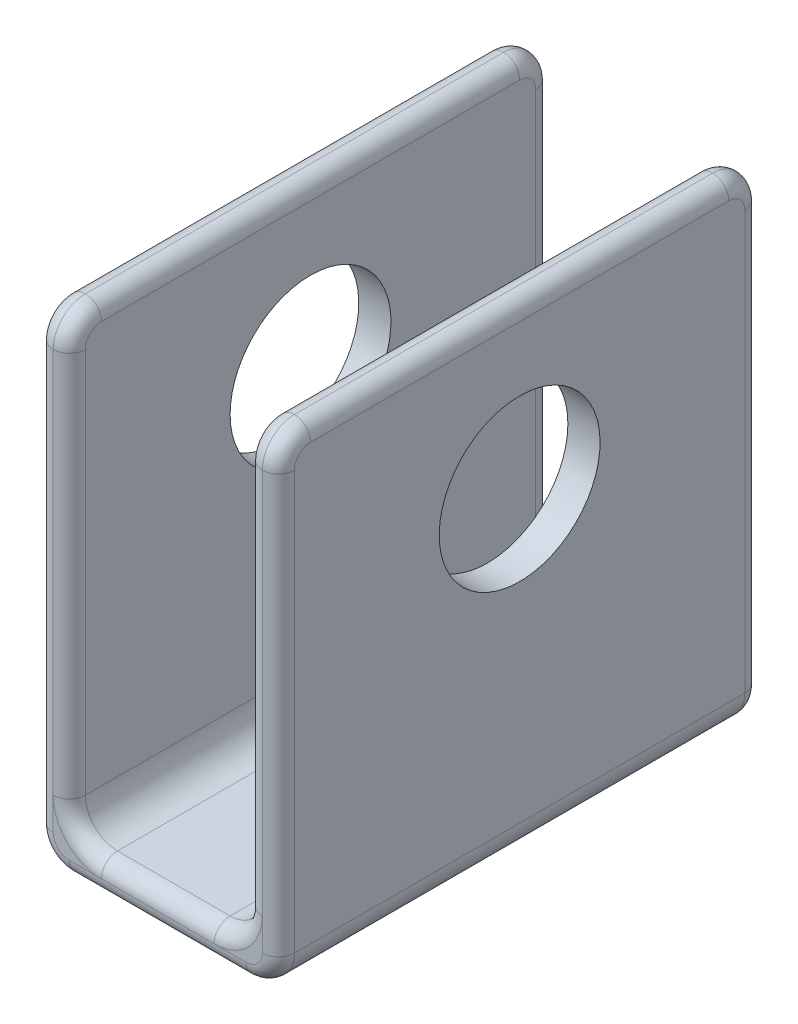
ISO-10303-21;
HEADER;
FILE_DESCRIPTION(('STEP AP214'),'2;1');
FILE_NAME('part.step','',(''),(''),'','','');
FILE_SCHEMA(('AUTOMOTIVE_DESIGN { 1 0 10303 214 1 1 1 1 }'));
ENDSEC;
DATA;
#1=APPLICATION_CONTEXT('core data for automotive mechanical design processes');
#2=APPLICATION_PROTOCOL_DEFINITION('international standard','automotive_design',2000,#1);
#3=PRODUCT_CONTEXT('',#1,'mechanical');
#4=PRODUCT('Part','Part','',(#3));
#5=PRODUCT_RELATED_PRODUCT_CATEGORY('part','',(#4));
#6=PRODUCT_DEFINITION_FORMATION('','',#4);
#7=PRODUCT_DEFINITION_CONTEXT('part definition',#1,'design');
#8=PRODUCT_DEFINITION('design','',#6,#7);
#9=PRODUCT_DEFINITION_SHAPE('','',#8);
#10=(LENGTH_UNIT() NAMED_UNIT(*) SI_UNIT(.MILLI.,.METRE.));
#11=(NAMED_UNIT(*) PLANE_ANGLE_UNIT() SI_UNIT($,.RADIAN.));
#12=(NAMED_UNIT(*) SI_UNIT($,.STERADIAN.) SOLID_ANGLE_UNIT());
#13=UNCERTAINTY_MEASURE_WITH_UNIT(LENGTH_MEASURE(1.E-05),#10,'distance_accuracy_value','');
#14=(GEOMETRIC_REPRESENTATION_CONTEXT(3) GLOBAL_UNCERTAINTY_ASSIGNED_CONTEXT((#13)) GLOBAL_UNIT_ASSIGNED_CONTEXT((#10,
#11,#12)) REPRESENTATION_CONTEXT('',''));
#15=CARTESIAN_POINT('',(0.,0.,0.));
#16=DIRECTION('',(0.,0.,1.));
#17=DIRECTION('',(1.,0.,0.));
#18=AXIS2_PLACEMENT_3D('',#15,#16,#17);
#19=CARTESIAN_POINT('',(-9.525,38.1,-19.05));
#20=DIRECTION('',(0.,0.,1.));
#21=DIRECTION('',(1.,0.,0.));
#22=AXIS2_PLACEMENT_3D('',#19,#20,#21);
#23=PLANE('',#22);
#24=CARTESIAN_POINT('',(4.445,5.08,-19.05));
#25=DIRECTION('',(0.,0.,1.));
#26=DIRECTION('',(1.,0.,0.));
#27=AXIS2_PLACEMENT_3D('',#24,#25,#26);
#28=CIRCLE('',#27,3.81);
#29=CARTESIAN_POINT('',(4.445,1.27,-19.05));
#30=VERTEX_POINT('',#29);
#31=CARTESIAN_POINT('',(8.255,5.08,-19.05));
#32=VERTEX_POINT('',#31);
#33=EDGE_CURVE('E396',#30,#32,#28,.T.);
#34=ORIENTED_EDGE('',*,*,#33,.T.);
#35=DIRECTION('',(0.,1.,0.));
#36=VECTOR('',#35,1.);
#37=CARTESIAN_POINT('',(8.255,38.1,-19.05));
#38=LINE('',#37,#36);
#39=CARTESIAN_POINT('',(8.255,2.54,-19.05));
#40=VERTEX_POINT('',#39);
#41=EDGE_CURVE('E389',#32,#40,#38,.F.);
#42=ORIENTED_EDGE('',*,*,#41,.T.);
#43=CARTESIAN_POINT('',(6.985,2.54,-19.05));
#44=DIRECTION('',(0.,0.,1.));
#45=DIRECTION('',(1.,0.,0.));
#46=AXIS2_PLACEMENT_3D('',#43,#44,#45);
#47=CIRCLE('',#46,1.27);
#48=CARTESIAN_POINT('',(6.985,1.27,-19.05));
#49=VERTEX_POINT('',#48);
#50=EDGE_CURVE('E392',#40,#49,#47,.F.);
#51=ORIENTED_EDGE('',*,*,#50,.T.);
#52=DIRECTION('',(1.,0.,0.));
#53=VECTOR('',#52,1.);
#54=CARTESIAN_POINT('',(-9.525,1.27,-19.05));
#55=LINE('',#54,#53);
#56=EDGE_CURVE('E394',#49,#30,#55,.F.);
#57=ORIENTED_EDGE('',*,*,#56,.T.);
#58=EDGE_LOOP('',(#34,#42,#51,#57));
#59=FACE_BOUND('',#58,.T.);
#60=ADVANCED_FACE('F34',(#59),#23,.F.);
#61=CARTESIAN_POINT('',(-9.525,38.1,19.05));
#62=DIRECTION('',(0.,0.,1.));
#63=DIRECTION('',(1.,0.,0.));
#64=AXIS2_PLACEMENT_3D('',#61,#62,#63);
#65=PLANE('',#64);
#66=CARTESIAN_POINT('',(-4.445,5.08,19.05));
#67=DIRECTION('',(0.,0.,1.));
#68=DIRECTION('',(1.,0.,0.));
#69=AXIS2_PLACEMENT_3D('',#66,#67,#68);
#70=CIRCLE('',#69,3.81);
#71=CARTESIAN_POINT('',(-4.445,1.27,19.05));
#72=VERTEX_POINT('',#71);
#73=CARTESIAN_POINT('',(-8.255,5.08,19.05));
#74=VERTEX_POINT('',#73);
#75=EDGE_CURVE('E436',#72,#74,#70,.F.);
#76=ORIENTED_EDGE('',*,*,#75,.T.);
#77=DIRECTION('',(0.,-1.,0.));
#78=VECTOR('',#77,1.);
#79=CARTESIAN_POINT('',(-8.255,2.54000000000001,19.05));
#80=LINE('',#79,#78);
#81=CARTESIAN_POINT('',(-8.255,2.54,19.05));
#82=VERTEX_POINT('',#81);
#83=EDGE_CURVE('E429',#74,#82,#80,.T.);
#84=ORIENTED_EDGE('',*,*,#83,.T.);
#85=CARTESIAN_POINT('',(-6.985,2.54,19.05));
#86=DIRECTION('',(0.,0.,1.));
#87=DIRECTION('',(1.,0.,0.));
#88=AXIS2_PLACEMENT_3D('',#85,#86,#87);
#89=CIRCLE('',#88,1.27);
#90=CARTESIAN_POINT('',(-6.985,1.27,19.05));
#91=VERTEX_POINT('',#90);
#92=EDGE_CURVE('E432',#82,#91,#89,.T.);
#93=ORIENTED_EDGE('',*,*,#92,.T.);
#94=DIRECTION('',(1.,0.,0.));
#95=VECTOR('',#94,1.);
#96=CARTESIAN_POINT('',(6.98499999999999,1.27,19.05));
#97=LINE('',#96,#95);
#98=EDGE_CURVE('E434',#91,#72,#97,.T.);
#99=ORIENTED_EDGE('',*,*,#98,.T.);
#100=EDGE_LOOP('',(#76,#84,#93,#99));
#101=FACE_BOUND('',#100,.T.);
#102=ADVANCED_FACE('F612',(#101),#65,.T.);
#103=CARTESIAN_POINT('',(-9.525,38.1,19.05));
#104=DIRECTION('',(1.,0.,0.));
#105=DIRECTION('',(0.,1.,0.));
#106=AXIS2_PLACEMENT_3D('',#103,#104,#105);
#107=PLANE('',#106);
#108=DIRECTION('',(0.,0.,-1.));
#109=VECTOR('',#108,1.);
#110=CARTESIAN_POINT('',(-9.525,2.54,19.05));
#111=LINE('',#110,#109);
#112=CARTESIAN_POINT('',(-9.525,2.54,-17.78));
#113=VERTEX_POINT('',#112);
#114=CARTESIAN_POINT('',(-9.525,2.54,17.78));
#115=VERTEX_POINT('',#114);
#116=EDGE_CURVE('E457',#113,#115,#111,.F.);
#117=ORIENTED_EDGE('',*,*,#116,.T.);
#118=DIRECTION('',(0.,-1.,0.));
#119=VECTOR('',#118,1.);
#120=CARTESIAN_POINT('',(-9.525,35.56,17.78));
#121=LINE('',#120,#119);
#122=CARTESIAN_POINT('',(-9.525,35.56,17.78));
#123=VERTEX_POINT('',#122);
#124=EDGE_CURVE('E447',#115,#123,#121,.F.);
#125=ORIENTED_EDGE('',*,*,#124,.T.);
#126=CARTESIAN_POINT('',(-9.525,35.56,16.51));
#127=DIRECTION('',(1.,0.,0.));
#128=DIRECTION('',(0.,1.,0.));
#129=AXIS2_PLACEMENT_3D('',#126,#127,#128);
#130=CIRCLE('',#129,1.27);
#131=CARTESIAN_POINT('',(-9.525,36.83,16.51));
#132=VERTEX_POINT('',#131);
#133=EDGE_CURVE('E449',#123,#132,#130,.F.);
#134=ORIENTED_EDGE('',*,*,#133,.T.);
#135=DIRECTION('',(0.,0.,-1.));
#136=VECTOR('',#135,1.);
#137=CARTESIAN_POINT('',(-9.525,36.83,19.05));
#138=LINE('',#137,#136);
#139=CARTESIAN_POINT('',(-9.525,36.83,-16.51));
#140=VERTEX_POINT('',#139);
#141=EDGE_CURVE('E455',#132,#140,#138,.T.);
#142=ORIENTED_EDGE('',*,*,#141,.T.);
#143=CARTESIAN_POINT('',(-9.525,35.56,-16.51));
#144=DIRECTION('',(1.,0.,0.));
#145=DIRECTION('',(0.,1.,0.));
#146=AXIS2_PLACEMENT_3D('',#143,#144,#145);
#147=CIRCLE('',#146,1.27);
#148=CARTESIAN_POINT('',(-9.525,35.56,-17.78));
#149=VERTEX_POINT('',#148);
#150=EDGE_CURVE('E453',#140,#149,#147,.F.);
#151=ORIENTED_EDGE('',*,*,#150,.T.);
#152=DIRECTION('',(0.,-1.,0.));
#153=VECTOR('',#152,1.);
#154=CARTESIAN_POINT('',(-9.525,38.1,-17.78));
#155=LINE('',#154,#153);
#156=EDGE_CURVE('E92',#149,#113,#155,.T.);
#157=ORIENTED_EDGE('',*,*,#156,.T.);
#158=EDGE_LOOP('',(#117,#125,#134,#142,#151,#157));
#159=FACE_BOUND('',#158,.T.);
#160=CARTESIAN_POINT('',(-9.525,25.4,0.));
#161=DIRECTION('',(1.,0.,0.));
#162=DIRECTION('',(0.,1.,0.));
#163=AXIS2_PLACEMENT_3D('',#160,#161,#162);
#164=CIRCLE('',#163,6.35);
#165=CARTESIAN_POINT('',(-9.525,31.75,0.));
#166=VERTEX_POINT('',#165);
#167=EDGE_CURVE('E243',#166,#166,#164,.T.);
#168=ORIENTED_EDGE('',*,*,#167,.T.);
#169=EDGE_LOOP('',(#168));
#170=FACE_BOUND('',#169,.T.);
#171=ADVANCED_FACE('F488',(#159,#170),#107,.F.);
#172=CARTESIAN_POINT('',(-9.525,0.,19.05));
#173=DIRECTION('',(0.,1.,0.));
#174=DIRECTION('',(0.,0.,1.));
#175=AXIS2_PLACEMENT_3D('',#172,#173,#174);
#176=PLANE('',#175);
#177=DIRECTION('',(0.,0.,-1.));
#178=VECTOR('',#177,1.);
#179=CARTESIAN_POINT('',(6.985,0.,19.05));
#180=LINE('',#179,#178);
#181=CARTESIAN_POINT('',(6.985,0.,-17.78));
#182=VERTEX_POINT('',#181);
#183=CARTESIAN_POINT('',(6.985,0.,17.78));
#184=VERTEX_POINT('',#183);
#185=EDGE_CURVE('E459',#182,#184,#180,.F.);
#186=ORIENTED_EDGE('',*,*,#185,.T.);
#187=DIRECTION('',(1.,0.,0.));
#188=VECTOR('',#187,1.);
#189=CARTESIAN_POINT('',(-6.985,0.,17.78));
#190=LINE('',#189,#188);
#191=CARTESIAN_POINT('',(-6.985,0.,17.78));
#192=VERTEX_POINT('',#191);
#193=EDGE_CURVE('E421',#184,#192,#190,.F.);
#194=ORIENTED_EDGE('',*,*,#193,.T.);
#195=DIRECTION('',(0.,0.,-1.));
#196=VECTOR('',#195,1.);
#197=CARTESIAN_POINT('',(-6.985,0.,19.05));
#198=LINE('',#197,#196);
#199=CARTESIAN_POINT('',(-6.985,0.,-17.78));
#200=VERTEX_POINT('',#199);
#201=EDGE_CURVE('E462',#192,#200,#198,.T.);
#202=ORIENTED_EDGE('',*,*,#201,.T.);
#203=DIRECTION('',(1.,0.,0.));
#204=VECTOR('',#203,1.);
#205=CARTESIAN_POINT('',(-9.525,0.,-17.78));
#206=LINE('',#205,#204);
#207=EDGE_CURVE('E423',#200,#182,#206,.T.);
#208=ORIENTED_EDGE('',*,*,#207,.T.);
#209=EDGE_LOOP('',(#186,#194,#202,#208));
#210=FACE_BOUND('',#209,.T.);
#211=ADVANCED_FACE('F1014',(#210),#176,.F.);
#212=CARTESIAN_POINT('',(9.525,0.,19.05));
#213=DIRECTION('',(-1.,0.,0.));
#214=DIRECTION('',(0.,-1.,0.));
#215=AXIS2_PLACEMENT_3D('',#212,#213,#214);
#216=PLANE('',#215);
#217=CARTESIAN_POINT('',(9.525,25.4,0.));
#218=DIRECTION('',(1.,0.,0.));
#219=DIRECTION('',(0.,1.,0.));
#220=AXIS2_PLACEMENT_3D('',#217,#218,#219);
#221=CIRCLE('',#220,6.35);
#222=CARTESIAN_POINT('',(9.525,31.75,0.));
#223=VERTEX_POINT('',#222);
#224=EDGE_CURVE('E241',#223,#223,#221,.T.);
#225=ORIENTED_EDGE('',*,*,#224,.F.);
#226=EDGE_LOOP('',(#225));
#227=FACE_BOUND('',#226,.T.);
#228=CARTESIAN_POINT('',(9.525,35.56,16.51));
#229=DIRECTION('',(-1.,0.,0.));
#230=DIRECTION('',(0.,-1.,0.));
#231=AXIS2_PLACEMENT_3D('',#228,#229,#230);
#232=CIRCLE('',#231,1.27);
#233=CARTESIAN_POINT('',(9.525,36.83,16.51));
#234=VERTEX_POINT('',#233);
#235=CARTESIAN_POINT('',(9.525,35.56,17.78));
#236=VERTEX_POINT('',#235);
#237=EDGE_CURVE('E409',#234,#236,#232,.F.);
#238=ORIENTED_EDGE('',*,*,#237,.T.);
#239=DIRECTION('',(0.,1.,0.));
#240=VECTOR('',#239,1.);
#241=CARTESIAN_POINT('',(9.525,2.54,17.78));
#242=LINE('',#241,#240);
#243=CARTESIAN_POINT('',(9.525,2.54,17.78));
#244=VERTEX_POINT('',#243);
#245=EDGE_CURVE('E407',#236,#244,#242,.F.);
#246=ORIENTED_EDGE('',*,*,#245,.T.);
#247=DIRECTION('',(0.,0.,-1.));
#248=VECTOR('',#247,1.);
#249=CARTESIAN_POINT('',(9.525,2.54,19.05));
#250=LINE('',#249,#248);
#251=CARTESIAN_POINT('',(9.525,2.54,-17.78));
#252=VERTEX_POINT('',#251);
#253=EDGE_CURVE('E465',#244,#252,#250,.T.);
#254=ORIENTED_EDGE('',*,*,#253,.T.);
#255=DIRECTION('',(0.,1.,0.));
#256=VECTOR('',#255,1.);
#257=CARTESIAN_POINT('',(9.525,0.,-17.78));
#258=LINE('',#257,#256);
#259=CARTESIAN_POINT('',(9.525,35.56,-17.78));
#260=VERTEX_POINT('',#259);
#261=EDGE_CURVE('E415',#252,#260,#258,.T.);
#262=ORIENTED_EDGE('',*,*,#261,.T.);
#263=CARTESIAN_POINT('',(9.525,35.56,-16.51));
#264=DIRECTION('',(-1.,0.,0.));
#265=DIRECTION('',(0.,-1.,0.));
#266=AXIS2_PLACEMENT_3D('',#263,#264,#265);
#267=CIRCLE('',#266,1.27);
#268=CARTESIAN_POINT('',(9.525,36.83,-16.51));
#269=VERTEX_POINT('',#268);
#270=EDGE_CURVE('E413',#260,#269,#267,.F.);
#271=ORIENTED_EDGE('',*,*,#270,.T.);
#272=DIRECTION('',(0.,0.,-1.));
#273=VECTOR('',#272,1.);
#274=CARTESIAN_POINT('',(9.525,36.83,19.05));
#275=LINE('',#274,#273);
#276=EDGE_CURVE('E411',#269,#234,#275,.F.);
#277=ORIENTED_EDGE('',*,*,#276,.T.);
#278=EDGE_LOOP('',(#238,#246,#254,#262,#271,#277));
#279=FACE_BOUND('',#278,.T.);
#280=ADVANCED_FACE('F627',(#227,#279),#216,.F.);
#281=CARTESIAN_POINT('',(6.985,38.1,19.05));
#282=DIRECTION('',(1.,0.,0.));
#283=DIRECTION('',(0.,0.,-1.));
#284=AXIS2_PLACEMENT_3D('',#281,#282,#283);
#285=PLANE('',#284);
#286=CARTESIAN_POINT('',(6.985,25.4,0.));
#287=DIRECTION('',(1.,0.,0.));
#288=DIRECTION('',(0.,0.,-1.));
#289=AXIS2_PLACEMENT_3D('',#286,#287,#288);
#290=CIRCLE('',#289,6.35);
#291=CARTESIAN_POINT('',(6.985,25.4,-6.35));
#292=VERTEX_POINT('',#291);
#293=EDGE_CURVE('E479',#292,#292,#290,.T.);
#294=ORIENTED_EDGE('',*,*,#293,.T.);
#295=EDGE_LOOP('',(#294));
#296=FACE_BOUND('',#295,.T.);
#297=DIRECTION('',(0.,0.,-1.));
#298=VECTOR('',#297,1.);
#299=CARTESIAN_POINT('',(6.985,5.08,19.05));
#300=LINE('',#299,#298);
#301=CARTESIAN_POINT('',(6.985,5.08,-17.78));
#302=VERTEX_POINT('',#301);
#303=CARTESIAN_POINT('',(6.985,5.08,17.78));
#304=VERTEX_POINT('',#303);
#305=EDGE_CURVE('E471',#302,#304,#300,.F.);
#306=ORIENTED_EDGE('',*,*,#305,.T.);
#307=DIRECTION('',(0.,-1.,0.));
#308=VECTOR('',#307,1.);
#309=CARTESIAN_POINT('',(6.985,35.56,17.78));
#310=LINE('',#309,#308);
#311=CARTESIAN_POINT('',(6.985,35.56,17.78));
#312=VERTEX_POINT('',#311);
#313=EDGE_CURVE('E11',#304,#312,#310,.F.);
#314=ORIENTED_EDGE('',*,*,#313,.T.);
#315=CARTESIAN_POINT('',(6.985,35.56,16.51));
#316=DIRECTION('',(1.,0.,0.));
#317=DIRECTION('',(0.,0.,-1.));
#318=AXIS2_PLACEMENT_3D('',#315,#316,#317);
#319=CIRCLE('',#318,1.27);
#320=CARTESIAN_POINT('',(6.985,36.83,16.51));
#321=VERTEX_POINT('',#320);
#322=EDGE_CURVE('E44',#312,#321,#319,.F.);
#323=ORIENTED_EDGE('',*,*,#322,.T.);
#324=DIRECTION('',(0.,0.,-1.));
#325=VECTOR('',#324,1.);
#326=CARTESIAN_POINT('',(6.985,36.83,19.05));
#327=LINE('',#326,#325);
#328=CARTESIAN_POINT('',(6.985,36.83,-16.51));
#329=VERTEX_POINT('',#328);
#330=EDGE_CURVE('E226',#321,#329,#327,.T.);
#331=ORIENTED_EDGE('',*,*,#330,.T.);
#332=CARTESIAN_POINT('',(6.985,35.56,-16.51));
#333=DIRECTION('',(1.,0.,0.));
#334=DIRECTION('',(0.,0.,-1.));
#335=AXIS2_PLACEMENT_3D('',#332,#333,#334);
#336=CIRCLE('',#335,1.27);
#337=CARTESIAN_POINT('',(6.985,35.56,-17.78));
#338=VERTEX_POINT('',#337);
#339=EDGE_CURVE('E228',#329,#338,#336,.F.);
#340=ORIENTED_EDGE('',*,*,#339,.T.);
#341=DIRECTION('',(0.,-1.,0.));
#342=VECTOR('',#341,1.);
#343=CARTESIAN_POINT('',(6.985,38.1,-17.78));
#344=LINE('',#343,#342);
#345=EDGE_CURVE('E234',#338,#302,#344,.T.);
#346=ORIENTED_EDGE('',*,*,#345,.T.);
#347=EDGE_LOOP('',(#306,#314,#323,#331,#340,#346));
#348=FACE_BOUND('',#347,.T.);
#349=ADVANCED_FACE('F227',(#296,#348),#285,.F.);
#350=CARTESIAN_POINT('',(6.985,2.54,19.05));
#351=DIRECTION('',(0.,-1.,0.));
#352=DIRECTION('',(0.,0.,-1.));
#353=AXIS2_PLACEMENT_3D('',#350,#351,#352);
#354=PLANE('',#353);
#355=DIRECTION('',(0.,0.,-1.));
#356=VECTOR('',#355,1.);
#357=CARTESIAN_POINT('',(-4.445,2.54,19.05));
#358=LINE('',#357,#356);
#359=CARTESIAN_POINT('',(-4.445,2.54,-17.78));
#360=VERTEX_POINT('',#359);
#361=CARTESIAN_POINT('',(-4.445,2.54,17.78));
#362=VERTEX_POINT('',#361);
#363=EDGE_CURVE('E476',#360,#362,#358,.F.);
#364=ORIENTED_EDGE('',*,*,#363,.T.);
#365=DIRECTION('',(-1.,0.,0.));
#366=VECTOR('',#365,1.);
#367=CARTESIAN_POINT('',(4.445,2.54,17.78));
#368=LINE('',#367,#366);
#369=CARTESIAN_POINT('',(4.445,2.54,17.78));
#370=VERTEX_POINT('',#369);
#371=EDGE_CURVE('E370',#362,#370,#368,.F.);
#372=ORIENTED_EDGE('',*,*,#371,.T.);
#373=DIRECTION('',(0.,0.,-1.));
#374=VECTOR('',#373,1.);
#375=CARTESIAN_POINT('',(4.445,2.54,-19.05));
#376=LINE('',#375,#374);
#377=CARTESIAN_POINT('',(4.445,2.54,-17.78));
#378=VERTEX_POINT('',#377);
#379=EDGE_CURVE('E473',#370,#378,#376,.T.);
#380=ORIENTED_EDGE('',*,*,#379,.T.);
#381=DIRECTION('',(-1.,0.,0.));
#382=VECTOR('',#381,1.);
#383=CARTESIAN_POINT('',(6.985,2.54,-17.78));
#384=LINE('',#383,#382);
#385=EDGE_CURVE('E372',#378,#360,#384,.T.);
#386=ORIENTED_EDGE('',*,*,#385,.T.);
#387=EDGE_LOOP('',(#364,#372,#380,#386));
#388=FACE_BOUND('',#387,.T.);
#389=ADVANCED_FACE('F502',(#388),#354,.F.);
#390=CARTESIAN_POINT('',(-6.985,2.54,19.05));
#391=DIRECTION('',(-1.,0.,0.));
#392=DIRECTION('',(0.,0.,1.));
#393=AXIS2_PLACEMENT_3D('',#390,#391,#392);
#394=PLANE('',#393);
#395=CARTESIAN_POINT('',(-6.985,25.4,0.));
#396=DIRECTION('',(-1.,0.,0.));
#397=DIRECTION('',(0.,0.,1.));
#398=AXIS2_PLACEMENT_3D('',#395,#396,#397);
#399=CIRCLE('',#398,6.35);
#400=CARTESIAN_POINT('',(-6.985,25.4,6.35));
#401=VERTEX_POINT('',#400);
#402=EDGE_CURVE('E480',#401,#401,#399,.T.);
#403=ORIENTED_EDGE('',*,*,#402,.T.);
#404=EDGE_LOOP('',(#403));
#405=FACE_BOUND('',#404,.T.);
#406=CARTESIAN_POINT('',(-6.985,35.56,16.51));
#407=DIRECTION('',(-1.,0.,0.));
#408=DIRECTION('',(0.,0.,1.));
#409=AXIS2_PLACEMENT_3D('',#406,#407,#408);
#410=CIRCLE('',#409,1.27);
#411=CARTESIAN_POINT('',(-6.985,36.83,16.51));
#412=VERTEX_POINT('',#411);
#413=CARTESIAN_POINT('',(-6.985,35.56,17.78));
#414=VERTEX_POINT('',#413);
#415=EDGE_CURVE('E380',#412,#414,#410,.F.);
#416=ORIENTED_EDGE('',*,*,#415,.T.);
#417=DIRECTION('',(0.,1.,0.));
#418=VECTOR('',#417,1.);
#419=CARTESIAN_POINT('',(-6.985,5.07999999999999,17.78));
#420=LINE('',#419,#418);
#421=CARTESIAN_POINT('',(-6.985,5.08,17.78));
#422=VERTEX_POINT('',#421);
#423=EDGE_CURVE('E378',#414,#422,#420,.F.);
#424=ORIENTED_EDGE('',*,*,#423,.T.);
#425=DIRECTION('',(0.,0.,-1.));
#426=VECTOR('',#425,1.);
#427=CARTESIAN_POINT('',(-6.985,5.08,-19.05));
#428=LINE('',#427,#426);
#429=CARTESIAN_POINT('',(-6.985,5.08,-17.78));
#430=VERTEX_POINT('',#429);
#431=EDGE_CURVE('E468',#422,#430,#428,.T.);
#432=ORIENTED_EDGE('',*,*,#431,.T.);
#433=DIRECTION('',(0.,1.,0.));
#434=VECTOR('',#433,1.);
#435=CARTESIAN_POINT('',(-6.985,2.54,-17.78));
#436=LINE('',#435,#434);
#437=CARTESIAN_POINT('',(-6.985,35.56,-17.78));
#438=VERTEX_POINT('',#437);
#439=EDGE_CURVE('E383',#430,#438,#436,.T.);
#440=ORIENTED_EDGE('',*,*,#439,.T.);
#441=CARTESIAN_POINT('',(-6.985,35.56,-16.51));
#442=DIRECTION('',(-1.,0.,0.));
#443=DIRECTION('',(0.,0.,1.));
#444=AXIS2_PLACEMENT_3D('',#441,#442,#443);
#445=CIRCLE('',#444,1.27);
#446=CARTESIAN_POINT('',(-6.985,36.83,-16.51));
#447=VERTEX_POINT('',#446);
#448=EDGE_CURVE('E385',#438,#447,#445,.F.);
#449=ORIENTED_EDGE('',*,*,#448,.T.);
#450=DIRECTION('',(0.,0.,-1.));
#451=VECTOR('',#450,1.);
#452=CARTESIAN_POINT('',(-6.985,36.83,19.05));
#453=LINE('',#452,#451);
#454=EDGE_CURVE('E387',#447,#412,#453,.F.);
#455=ORIENTED_EDGE('',*,*,#454,.T.);
#456=EDGE_LOOP('',(#416,#424,#432,#440,#449,#455));
#457=FACE_BOUND('',#456,.T.);
#458=ADVANCED_FACE('F498',(#405,#457),#394,.F.);
#459=CARTESIAN_POINT('',(4.445,5.08,19.05));
#460=DIRECTION('',(0.,0.,1.));
#461=DIRECTION('',(1.,0.,0.));
#462=AXIS2_PLACEMENT_3D('',#459,#460,#461);
#463=CIRCLE('',#462,3.81);
#464=CARTESIAN_POINT('',(8.255,5.08,19.05));
#465=VERTEX_POINT('',#464);
#466=CARTESIAN_POINT('',(4.445,1.27,19.05));
#467=VERTEX_POINT('',#466);
#468=EDGE_CURVE('E445',#465,#467,#463,.F.);
#469=ORIENTED_EDGE('',*,*,#468,.T.);
#470=DIRECTION('',(1.,0.,0.));
#471=VECTOR('',#470,1.);
#472=CARTESIAN_POINT('',(6.98499999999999,1.27,19.05));
#473=LINE('',#472,#471);
#474=CARTESIAN_POINT('',(6.985,1.27,19.05));
#475=VERTEX_POINT('',#474);
#476=EDGE_CURVE('E438',#467,#475,#473,.T.);
#477=ORIENTED_EDGE('',*,*,#476,.T.);
#478=CARTESIAN_POINT('',(6.985,2.54,19.05));
#479=DIRECTION('',(0.,0.,1.));
#480=DIRECTION('',(1.,0.,0.));
#481=AXIS2_PLACEMENT_3D('',#478,#479,#480);
#482=CIRCLE('',#481,1.27);
#483=CARTESIAN_POINT('',(8.255,2.54,19.05));
#484=VERTEX_POINT('',#483);
#485=EDGE_CURVE('E441',#475,#484,#482,.T.);
#486=ORIENTED_EDGE('',*,*,#485,.T.);
#487=DIRECTION('',(0.,1.,0.));
#488=VECTOR('',#487,1.);
#489=CARTESIAN_POINT('',(8.255,35.56,19.05));
#490=LINE('',#489,#488);
#491=EDGE_CURVE('E443',#484,#465,#490,.T.);
#492=ORIENTED_EDGE('',*,*,#491,.T.);
#493=EDGE_LOOP('',(#469,#477,#486,#492));
#494=FACE_BOUND('',#493,.T.);
#495=ADVANCED_FACE('F501',(#494),#65,.T.);
#496=CARTESIAN_POINT('',(-4.445,5.08,-19.05));
#497=DIRECTION('',(0.,0.,1.));
#498=DIRECTION('',(1.,0.,0.));
#499=AXIS2_PLACEMENT_3D('',#496,#497,#498);
#500=CIRCLE('',#499,3.81);
#501=CARTESIAN_POINT('',(-8.255,5.08,-19.05));
#502=VERTEX_POINT('',#501);
#503=CARTESIAN_POINT('',(-4.445,1.27,-19.05));
#504=VERTEX_POINT('',#503);
#505=EDGE_CURVE('E405',#502,#504,#500,.T.);
#506=ORIENTED_EDGE('',*,*,#505,.T.);
#507=DIRECTION('',(1.,0.,0.));
#508=VECTOR('',#507,1.);
#509=CARTESIAN_POINT('',(-9.525,1.27,-19.05));
#510=LINE('',#509,#508);
#511=CARTESIAN_POINT('',(-6.985,1.27,-19.05));
#512=VERTEX_POINT('',#511);
#513=EDGE_CURVE('E398',#504,#512,#510,.F.);
#514=ORIENTED_EDGE('',*,*,#513,.T.);
#515=CARTESIAN_POINT('',(-6.985,2.54,-19.05));
#516=DIRECTION('',(0.,0.,1.));
#517=DIRECTION('',(1.,0.,0.));
#518=AXIS2_PLACEMENT_3D('',#515,#516,#517);
#519=CIRCLE('',#518,1.27);
#520=CARTESIAN_POINT('',(-8.255,2.54,-19.05));
#521=VERTEX_POINT('',#520);
#522=EDGE_CURVE('E401',#512,#521,#519,.F.);
#523=ORIENTED_EDGE('',*,*,#522,.T.);
#524=DIRECTION('',(0.,-1.,0.));
#525=VECTOR('',#524,1.);
#526=CARTESIAN_POINT('',(-8.255,38.1,-19.05));
#527=LINE('',#526,#525);
#528=EDGE_CURVE('E403',#521,#502,#527,.F.);
#529=ORIENTED_EDGE('',*,*,#528,.T.);
#530=EDGE_LOOP('',(#506,#514,#523,#529));
#531=FACE_BOUND('',#530,.T.);
#532=ADVANCED_FACE('F494',(#531),#23,.F.);
#533=CARTESIAN_POINT('',(-9.525,25.4,0.));
#534=DIRECTION('',(1.,0.,0.));
#535=DIRECTION('',(0.,1.,0.));
#536=AXIS2_PLACEMENT_3D('',#533,#534,#535);
#537=CYLINDRICAL_SURFACE('',#536,6.35);
#538=ORIENTED_EDGE('',*,*,#167,.F.);
#539=EDGE_LOOP('',(#538));
#540=FACE_BOUND('',#539,.T.);
#541=ORIENTED_EDGE('',*,*,#402,.F.);
#542=EDGE_LOOP('',(#541));
#543=FACE_BOUND('',#542,.T.);
#544=ADVANCED_FACE('F490',(#540,#543),#537,.F.);
#545=ORIENTED_EDGE('',*,*,#224,.T.);
#546=EDGE_LOOP('',(#545));
#547=FACE_BOUND('',#546,.T.);
#548=ORIENTED_EDGE('',*,*,#293,.F.);
#549=EDGE_LOOP('',(#548));
#550=FACE_BOUND('',#549,.T.);
#551=ADVANCED_FACE('F493',(#547,#550),#537,.F.);
#552=CARTESIAN_POINT('',(4.445,5.08,19.05));
#553=DIRECTION('',(0.,0.,1.));
#554=DIRECTION('',(1.,0.,0.));
#555=AXIS2_PLACEMENT_3D('',#552,#553,#554);
#556=CYLINDRICAL_SURFACE('',#555,2.54);
#557=ORIENTED_EDGE('',*,*,#379,.F.);
#558=CARTESIAN_POINT('',(4.445,5.08,17.78));
#559=DIRECTION('',(0.,0.,1.));
#560=DIRECTION('',(1.,0.,0.));
#561=AXIS2_PLACEMENT_3D('',#558,#559,#560);
#562=CIRCLE('',#561,2.54);
#563=EDGE_CURVE('E366',#370,#304,#562,.T.);
#564=ORIENTED_EDGE('',*,*,#563,.T.);
#565=ORIENTED_EDGE('',*,*,#305,.F.);
#566=CARTESIAN_POINT('',(4.445,5.08,-17.78));
#567=DIRECTION('',(0.,0.,1.));
#568=DIRECTION('',(1.,0.,0.));
#569=AXIS2_PLACEMENT_3D('',#566,#567,#568);
#570=CIRCLE('',#569,2.54);
#571=EDGE_CURVE('E368',#302,#378,#570,.F.);
#572=ORIENTED_EDGE('',*,*,#571,.T.);
#573=EDGE_LOOP('',(#557,#564,#565,#572));
#574=FACE_BOUND('',#573,.T.);
#575=ADVANCED_FACE('F543',(#574),#556,.F.);
#576=CARTESIAN_POINT('',(-4.445,5.08,19.05));
#577=DIRECTION('',(0.,0.,1.));
#578=DIRECTION('',(1.,0.,0.));
#579=AXIS2_PLACEMENT_3D('',#576,#577,#578);
#580=CYLINDRICAL_SURFACE('',#579,2.54);
#581=ORIENTED_EDGE('',*,*,#431,.F.);
#582=CARTESIAN_POINT('',(-4.445,5.08,17.78));
#583=DIRECTION('',(0.,0.,1.));
#584=DIRECTION('',(1.,0.,0.));
#585=AXIS2_PLACEMENT_3D('',#582,#583,#584);
#586=CIRCLE('',#585,2.54);
#587=EDGE_CURVE('E374',#422,#362,#586,.T.);
#588=ORIENTED_EDGE('',*,*,#587,.T.);
#589=ORIENTED_EDGE('',*,*,#363,.F.);
#590=CARTESIAN_POINT('',(-4.445,5.08,-17.78));
#591=DIRECTION('',(0.,0.,1.));
#592=DIRECTION('',(1.,0.,0.));
#593=AXIS2_PLACEMENT_3D('',#590,#591,#592);
#594=CIRCLE('',#593,2.54);
#595=EDGE_CURVE('E376',#360,#430,#594,.F.);
#596=ORIENTED_EDGE('',*,*,#595,.T.);
#597=EDGE_LOOP('',(#581,#588,#589,#596));
#598=FACE_BOUND('',#597,.T.);
#599=ADVANCED_FACE('F525',(#598),#580,.F.);
#600=CARTESIAN_POINT('',(6.985,2.54,19.05));
#601=DIRECTION('',(0.,0.,-1.));
#602=DIRECTION('',(-1.,0.,0.));
#603=AXIS2_PLACEMENT_3D('',#600,#601,#602);
#604=CYLINDRICAL_SURFACE('',#603,2.54);
#605=ORIENTED_EDGE('',*,*,#253,.F.);
#606=CARTESIAN_POINT('',(6.985,2.54,17.78));
#607=DIRECTION('',(0.,0.,1.));
#608=DIRECTION('',(1.,0.,0.));
#609=AXIS2_PLACEMENT_3D('',#606,#607,#608);
#610=CIRCLE('',#609,2.54);
#611=EDGE_CURVE('E417',#244,#184,#610,.F.);
#612=ORIENTED_EDGE('',*,*,#611,.T.);
#613=ORIENTED_EDGE('',*,*,#185,.F.);
#614=CARTESIAN_POINT('',(6.985,2.54,-17.78));
#615=DIRECTION('',(0.,0.,1.));
#616=DIRECTION('',(1.,0.,0.));
#617=AXIS2_PLACEMENT_3D('',#614,#615,#616);
#618=CIRCLE('',#617,2.54);
#619=EDGE_CURVE('E419',#182,#252,#618,.T.);
#620=ORIENTED_EDGE('',*,*,#619,.T.);
#621=EDGE_LOOP('',(#605,#612,#613,#620));
#622=FACE_BOUND('',#621,.T.);
#623=ADVANCED_FACE('F629',(#622),#604,.T.);
#624=CARTESIAN_POINT('',(-6.985,2.54,19.05));
#625=DIRECTION('',(0.,0.,-1.));
#626=DIRECTION('',(-1.,0.,0.));
#627=AXIS2_PLACEMENT_3D('',#624,#625,#626);
#628=CYLINDRICAL_SURFACE('',#627,2.54);
#629=ORIENTED_EDGE('',*,*,#201,.F.);
#630=CARTESIAN_POINT('',(-6.985,2.54,17.78));
#631=DIRECTION('',(0.,0.,1.));
#632=DIRECTION('',(1.,0.,0.));
#633=AXIS2_PLACEMENT_3D('',#630,#631,#632);
#634=CIRCLE('',#633,2.54);
#635=EDGE_CURVE('E425',#192,#115,#634,.F.);
#636=ORIENTED_EDGE('',*,*,#635,.T.);
#637=ORIENTED_EDGE('',*,*,#116,.F.);
#638=CARTESIAN_POINT('',(-6.985,2.54,-17.78));
#639=DIRECTION('',(0.,0.,1.));
#640=DIRECTION('',(1.,0.,0.));
#641=AXIS2_PLACEMENT_3D('',#638,#639,#640);
#642=CIRCLE('',#641,2.54);
#643=EDGE_CURVE('E427',#113,#200,#642,.T.);
#644=ORIENTED_EDGE('',*,*,#643,.T.);
#645=EDGE_LOOP('',(#629,#636,#637,#644));
#646=FACE_BOUND('',#645,.T.);
#647=ADVANCED_FACE('F722',(#646),#628,.T.);
#648=CARTESIAN_POINT('',(8.255,35.56,-16.51));
#649=DIRECTION('',(1.,0.,0.));
#650=DIRECTION('',(0.,0.,-1.));
#651=AXIS2_PLACEMENT_3D('',#648,#649,#650);
#652=DEGENERATE_TOROIDAL_SURFACE('',#651,1.27,1.27,.T.);
#653=CARTESIAN_POINT('',(8.255,35.56,-17.78));
#654=DIRECTION('',(0.,-1.,0.));
#655=DIRECTION('',(0.,0.,-1.));
#656=AXIS2_PLACEMENT_3D('',#653,#654,#655);
#657=CIRCLE('',#656,1.27);
#658=CARTESIAN_POINT('',(8.255,35.56,-19.05));
#659=VERTEX_POINT('',#658);
#660=EDGE_CURVE('E232',#338,#659,#657,.T.);
#661=ORIENTED_EDGE('',*,*,#660,.F.);
#662=ORIENTED_EDGE('',*,*,#339,.F.);
#663=CARTESIAN_POINT('',(8.255,36.83,-16.51));
#664=DIRECTION('',(0.,0.,1.));
#665=DIRECTION('',(1.,0.,0.));
#666=AXIS2_PLACEMENT_3D('',#663,#664,#665);
#667=CIRCLE('',#666,1.27);
#668=CARTESIAN_POINT('',(8.25500000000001,38.1,-16.51));
#669=VERTEX_POINT('',#668);
#670=EDGE_CURVE('E38',#669,#329,#667,.T.);
#671=ORIENTED_EDGE('',*,*,#670,.F.);
#672=CARTESIAN_POINT('',(8.25500000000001,35.56,-16.51));
#673=DIRECTION('',(1.,0.,0.));
#674=DIRECTION('',(0.,0.,-1.));
#675=AXIS2_PLACEMENT_3D('',#672,#673,#674);
#676=CIRCLE('',#675,2.54);
#677=EDGE_CURVE('E80',#659,#669,#676,.T.);
#678=ORIENTED_EDGE('',*,*,#677,.F.);
#679=EDGE_LOOP('',(#661,#662,#671,#678));
#680=FACE_BOUND('',#679,.T.);
#681=ADVANCED_FACE('F36',(#680),#652,.T.);
#682=CARTESIAN_POINT('',(8.255,36.83,19.05));
#683=DIRECTION('',(0.,0.,-1.));
#684=DIRECTION('',(-1.,0.,0.));
#685=AXIS2_PLACEMENT_3D('',#682,#683,#684);
#686=CYLINDRICAL_SURFACE('',#685,1.27);
#687=ORIENTED_EDGE('',*,*,#670,.T.);
#688=ORIENTED_EDGE('',*,*,#330,.F.);
#689=CARTESIAN_POINT('',(8.255,36.83,16.51));
#690=DIRECTION('',(0.,0.,1.));
#691=DIRECTION('',(1.,0.,0.));
#692=AXIS2_PLACEMENT_3D('',#689,#690,#691);
#693=CIRCLE('',#692,1.27);
#694=CARTESIAN_POINT('',(8.25500000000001,38.1,16.51));
#695=VERTEX_POINT('',#694);
#696=EDGE_CURVE('E248',#695,#321,#693,.T.);
#697=ORIENTED_EDGE('',*,*,#696,.F.);
#698=DIRECTION('',(0.,0.,-1.));
#699=VECTOR('',#698,1.);
#700=CARTESIAN_POINT('',(8.25500000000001,38.1,19.05));
#701=LINE('',#700,#699);
#702=EDGE_CURVE('E239',#669,#695,#701,.F.);
#703=ORIENTED_EDGE('',*,*,#702,.F.);
#704=EDGE_LOOP('',(#687,#688,#697,#703));
#705=FACE_BOUND('',#704,.T.);
#706=ADVANCED_FACE('F237',(#705),#686,.T.);
#707=CARTESIAN_POINT('',(8.255,35.56,-16.51));
#708=DIRECTION('',(-1.,0.,0.));
#709=DIRECTION('',(0.,-1.,0.));
#710=AXIS2_PLACEMENT_3D('',#707,#708,#709);
#711=DEGENERATE_TOROIDAL_SURFACE('',#710,1.27,1.27,.T.);
#712=CARTESIAN_POINT('',(8.255,35.56,-17.78));
#713=DIRECTION('',(0.,-1.,0.));
#714=DIRECTION('',(0.,0.,-1.));
#715=AXIS2_PLACEMENT_3D('',#712,#713,#714);
#716=CIRCLE('',#715,1.27);
#717=EDGE_CURVE('E255',#659,#260,#716,.T.);
#718=ORIENTED_EDGE('',*,*,#717,.F.);
#719=ORIENTED_EDGE('',*,*,#677,.T.);
#720=CARTESIAN_POINT('',(8.255,36.83,-16.51));
#721=DIRECTION('',(0.,0.,1.));
#722=DIRECTION('',(1.,0.,0.));
#723=AXIS2_PLACEMENT_3D('',#720,#721,#722);
#724=CIRCLE('',#723,1.27);
#725=EDGE_CURVE('E253',#269,#669,#724,.T.);
#726=ORIENTED_EDGE('',*,*,#725,.F.);
#727=ORIENTED_EDGE('',*,*,#270,.F.);
#728=EDGE_LOOP('',(#718,#719,#726,#727));
#729=FACE_BOUND('',#728,.T.);
#730=ADVANCED_FACE('F561',(#729),#711,.T.);
#731=CARTESIAN_POINT('',(8.255,38.1,-17.78));
#732=DIRECTION('',(0.,-1.,0.));
#733=DIRECTION('',(0.,0.,-1.));
#734=AXIS2_PLACEMENT_3D('',#731,#732,#733);
#735=CYLINDRICAL_SURFACE('',#734,1.27);
#736=ORIENTED_EDGE('',*,*,#345,.F.);
#737=ORIENTED_EDGE('',*,*,#660,.T.);
#738=DIRECTION('',(0.,-1.,0.));
#739=VECTOR('',#738,1.);
#740=CARTESIAN_POINT('',(8.255,38.1,-19.05));
#741=LINE('',#740,#739);
#742=EDGE_CURVE('E258',#32,#659,#741,.F.);
#743=ORIENTED_EDGE('',*,*,#742,.F.);
#744=CARTESIAN_POINT('',(8.255,5.08,-17.78));
#745=DIRECTION('',(0.,-1.,0.));
#746=DIRECTION('',(0.,0.,-1.));
#747=AXIS2_PLACEMENT_3D('',#744,#745,#746);
#748=CIRCLE('',#747,1.27);
#749=EDGE_CURVE('E261',#302,#32,#748,.T.);
#750=ORIENTED_EDGE('',*,*,#749,.F.);
#751=EDGE_LOOP('',(#736,#737,#743,#750));
#752=FACE_BOUND('',#751,.T.);
#753=ADVANCED_FACE('F570',(#752),#735,.T.);
#754=CARTESIAN_POINT('',(8.255,35.56,16.51));
#755=DIRECTION('',(1.,0.,0.));
#756=DIRECTION('',(0.,0.,-1.));
#757=AXIS2_PLACEMENT_3D('',#754,#755,#756);
#758=DEGENERATE_TOROIDAL_SURFACE('',#757,1.27,1.27,.T.);
#759=ORIENTED_EDGE('',*,*,#696,.T.);
#760=ORIENTED_EDGE('',*,*,#322,.F.);
#761=CARTESIAN_POINT('',(8.255,35.56,17.78));
#762=DIRECTION('',(0.,-1.,0.));
#763=DIRECTION('',(0.,0.,-1.));
#764=AXIS2_PLACEMENT_3D('',#761,#762,#763);
#765=CIRCLE('',#764,1.27);
#766=CARTESIAN_POINT('',(8.255,35.56,19.05));
#767=VERTEX_POINT('',#766);
#768=EDGE_CURVE('E264',#767,#312,#765,.T.);
#769=ORIENTED_EDGE('',*,*,#768,.F.);
#770=CARTESIAN_POINT('',(8.255,35.56,16.51));
#771=DIRECTION('',(1.,0.,0.));
#772=DIRECTION('',(0.,0.,-1.));
#773=AXIS2_PLACEMENT_3D('',#770,#771,#772);
#774=CIRCLE('',#773,2.54);
#775=EDGE_CURVE('E267',#695,#767,#774,.T.);
#776=ORIENTED_EDGE('',*,*,#775,.F.);
#777=EDGE_LOOP('',(#759,#760,#769,#776));
#778=FACE_BOUND('',#777,.T.);
#779=ADVANCED_FACE('F550',(#778),#758,.T.);
#780=CARTESIAN_POINT('',(8.255,36.83,19.05));
#781=DIRECTION('',(0.,0.,-1.));
#782=DIRECTION('',(-1.,0.,0.));
#783=AXIS2_PLACEMENT_3D('',#780,#781,#782);
#784=CYLINDRICAL_SURFACE('',#783,1.27);
#785=ORIENTED_EDGE('',*,*,#725,.T.);
#786=ORIENTED_EDGE('',*,*,#702,.T.);
#787=CARTESIAN_POINT('',(8.255,36.83,16.51));
#788=DIRECTION('',(0.,0.,1.));
#789=DIRECTION('',(1.,0.,0.));
#790=AXIS2_PLACEMENT_3D('',#787,#788,#789);
#791=CIRCLE('',#790,1.27);
#792=EDGE_CURVE('E270',#234,#695,#791,.T.);
#793=ORIENTED_EDGE('',*,*,#792,.F.);
#794=ORIENTED_EDGE('',*,*,#276,.F.);
#795=EDGE_LOOP('',(#785,#786,#793,#794));
#796=FACE_BOUND('',#795,.T.);
#797=ADVANCED_FACE('F559',(#796),#784,.T.);
#798=CARTESIAN_POINT('',(8.255,0.,-17.78));
#799=DIRECTION('',(0.,1.,0.));
#800=DIRECTION('',(-1.,0.,0.));
#801=AXIS2_PLACEMENT_3D('',#798,#799,#800);
#802=CYLINDRICAL_SURFACE('',#801,1.27);
#803=ORIENTED_EDGE('',*,*,#717,.T.);
#804=ORIENTED_EDGE('',*,*,#261,.F.);
#805=CARTESIAN_POINT('',(8.255,2.54,-17.78));
#806=DIRECTION('',(0.,-1.,0.));
#807=DIRECTION('',(0.,0.,-1.));
#808=AXIS2_PLACEMENT_3D('',#805,#806,#807);
#809=CIRCLE('',#808,1.27);
#810=EDGE_CURVE('E273',#40,#252,#809,.T.);
#811=ORIENTED_EDGE('',*,*,#810,.F.);
#812=ORIENTED_EDGE('',*,*,#41,.F.);
#813=ORIENTED_EDGE('',*,*,#742,.T.);
#814=EDGE_LOOP('',(#803,#804,#811,#812,#813));
#815=FACE_BOUND('',#814,.T.);
#816=ADVANCED_FACE('F565',(#815),#802,.T.);
#817=CARTESIAN_POINT('',(4.445,5.08,-17.78));
#818=DIRECTION('',(0.,0.,1.));
#819=DIRECTION('',(1.,0.,0.));
#820=AXIS2_PLACEMENT_3D('',#817,#818,#819);
#821=TOROIDAL_SURFACE('',#820,3.81,1.27);
#822=ORIENTED_EDGE('',*,*,#749,.T.);
#823=ORIENTED_EDGE('',*,*,#33,.F.);
#824=CARTESIAN_POINT('',(4.445,1.27,-17.78));
#825=DIRECTION('',(-1.,0.,0.));
#826=DIRECTION('',(0.,0.,1.));
#827=AXIS2_PLACEMENT_3D('',#824,#825,#826);
#828=CIRCLE('',#827,1.27);
#829=EDGE_CURVE('E276',#378,#30,#828,.T.);
#830=ORIENTED_EDGE('',*,*,#829,.F.);
#831=ORIENTED_EDGE('',*,*,#571,.F.);
#832=EDGE_LOOP('',(#822,#823,#830,#831));
#833=FACE_BOUND('',#832,.T.);
#834=ADVANCED_FACE('F575',(#833),#821,.T.);
#835=CARTESIAN_POINT('',(8.255,38.1,17.78));
#836=DIRECTION('',(0.,1.,0.));
#837=DIRECTION('',(0.,0.,1.));
#838=AXIS2_PLACEMENT_3D('',#835,#836,#837);
#839=CYLINDRICAL_SURFACE('',#838,1.27);
#840=ORIENTED_EDGE('',*,*,#768,.T.);
#841=ORIENTED_EDGE('',*,*,#313,.F.);
#842=CARTESIAN_POINT('',(8.255,5.08,17.78));
#843=DIRECTION('',(0.,-1.,0.));
#844=DIRECTION('',(0.,0.,-1.));
#845=AXIS2_PLACEMENT_3D('',#842,#843,#844);
#846=CIRCLE('',#845,1.27);
#847=EDGE_CURVE('E279',#465,#304,#846,.T.);
#848=ORIENTED_EDGE('',*,*,#847,.F.);
#849=DIRECTION('',(0.,-1.,0.));
#850=VECTOR('',#849,1.);
#851=CARTESIAN_POINT('',(8.255,5.08,19.05));
#852=LINE('',#851,#850);
#853=EDGE_CURVE('E282',#767,#465,#852,.T.);
#854=ORIENTED_EDGE('',*,*,#853,.F.);
#855=EDGE_LOOP('',(#840,#841,#848,#854));
#856=FACE_BOUND('',#855,.T.);
#857=ADVANCED_FACE('F546',(#856),#839,.T.);
#858=CARTESIAN_POINT('',(8.255,35.56,16.51));
#859=DIRECTION('',(-1.,0.,0.));
#860=DIRECTION('',(0.,-1.,0.));
#861=AXIS2_PLACEMENT_3D('',#858,#859,#860);
#862=DEGENERATE_TOROIDAL_SURFACE('',#861,1.27,1.27,.T.);
#863=ORIENTED_EDGE('',*,*,#792,.T.);
#864=ORIENTED_EDGE('',*,*,#775,.T.);
#865=CARTESIAN_POINT('',(8.255,35.56,17.78));
#866=DIRECTION('',(0.,-1.,0.));
#867=DIRECTION('',(0.,0.,-1.));
#868=AXIS2_PLACEMENT_3D('',#865,#866,#867);
#869=CIRCLE('',#868,1.27);
#870=EDGE_CURVE('E285',#236,#767,#869,.T.);
#871=ORIENTED_EDGE('',*,*,#870,.F.);
#872=ORIENTED_EDGE('',*,*,#237,.F.);
#873=EDGE_LOOP('',(#863,#864,#871,#872));
#874=FACE_BOUND('',#873,.T.);
#875=ADVANCED_FACE('F553',(#874),#862,.T.);
#876=CARTESIAN_POINT('',(6.985,2.54,-17.78));
#877=DIRECTION('',(0.,0.,1.));
#878=DIRECTION('',(1.,0.,0.));
#879=AXIS2_PLACEMENT_3D('',#876,#877,#878);
#880=DEGENERATE_TOROIDAL_SURFACE('',#879,1.27,1.27,.T.);
#881=ORIENTED_EDGE('',*,*,#810,.T.);
#882=ORIENTED_EDGE('',*,*,#619,.F.);
#883=CARTESIAN_POINT('',(6.985,1.27,-17.78));
#884=DIRECTION('',(-1.,0.,0.));
#885=DIRECTION('',(0.,0.,1.));
#886=AXIS2_PLACEMENT_3D('',#883,#884,#885);
#887=CIRCLE('',#886,1.27);
#888=EDGE_CURVE('E288',#49,#182,#887,.T.);
#889=ORIENTED_EDGE('',*,*,#888,.F.);
#890=ORIENTED_EDGE('',*,*,#50,.F.);
#891=EDGE_LOOP('',(#881,#882,#889,#890));
#892=FACE_BOUND('',#891,.T.);
#893=ADVANCED_FACE('F634',(#892),#880,.T.);
#894=CARTESIAN_POINT('',(6.985,1.27,-17.78));
#895=DIRECTION('',(-1.,0.,0.));
#896=DIRECTION('',(0.,0.,1.));
#897=AXIS2_PLACEMENT_3D('',#894,#895,#896);
#898=CYLINDRICAL_SURFACE('',#897,1.27);
#899=ORIENTED_EDGE('',*,*,#385,.F.);
#900=ORIENTED_EDGE('',*,*,#829,.T.);
#901=DIRECTION('',(-1.,0.,0.));
#902=VECTOR('',#901,1.);
#903=CARTESIAN_POINT('',(-9.525,1.27,-19.05));
#904=LINE('',#903,#902);
#905=EDGE_CURVE('E291',#504,#30,#904,.F.);
#906=ORIENTED_EDGE('',*,*,#905,.F.);
#907=CARTESIAN_POINT('',(-4.445,1.27,-17.78));
#908=DIRECTION('',(-1.,0.,0.));
#909=DIRECTION('',(0.,0.,1.));
#910=AXIS2_PLACEMENT_3D('',#907,#908,#909);
#911=CIRCLE('',#910,1.27);
#912=EDGE_CURVE('E294',#360,#504,#911,.T.);
#913=ORIENTED_EDGE('',*,*,#912,.F.);
#914=EDGE_LOOP('',(#899,#900,#906,#913));
#915=FACE_BOUND('',#914,.T.);
#916=ADVANCED_FACE('F578',(#915),#898,.T.);
#917=CARTESIAN_POINT('',(4.445,5.08,17.78));
#918=DIRECTION('',(0.,0.,1.));
#919=DIRECTION('',(1.,0.,0.));
#920=AXIS2_PLACEMENT_3D('',#917,#918,#919);
#921=TOROIDAL_SURFACE('',#920,3.81,1.27);
#922=ORIENTED_EDGE('',*,*,#847,.T.);
#923=ORIENTED_EDGE('',*,*,#563,.F.);
#924=CARTESIAN_POINT('',(4.445,1.27,17.78));
#925=DIRECTION('',(-1.,0.,0.));
#926=DIRECTION('',(0.,0.,1.));
#927=AXIS2_PLACEMENT_3D('',#924,#925,#926);
#928=CIRCLE('',#927,1.27);
#929=EDGE_CURVE('E297',#467,#370,#928,.T.);
#930=ORIENTED_EDGE('',*,*,#929,.F.);
#931=ORIENTED_EDGE('',*,*,#468,.F.);
#932=EDGE_LOOP('',(#922,#923,#930,#931));
#933=FACE_BOUND('',#932,.T.);
#934=ADVANCED_FACE('F539',(#933),#921,.T.);
#935=CARTESIAN_POINT('',(8.255,38.1,17.78));
#936=DIRECTION('',(0.,-1.,0.));
#937=DIRECTION('',(1.,0.,0.));
#938=AXIS2_PLACEMENT_3D('',#935,#936,#937);
#939=CYLINDRICAL_SURFACE('',#938,1.27);
#940=ORIENTED_EDGE('',*,*,#853,.T.);
#941=ORIENTED_EDGE('',*,*,#491,.F.);
#942=CARTESIAN_POINT('',(8.255,2.54,17.78));
#943=DIRECTION('',(0.,-1.,0.));
#944=DIRECTION('',(0.,0.,-1.));
#945=AXIS2_PLACEMENT_3D('',#942,#943,#944);
#946=CIRCLE('',#945,1.27);
#947=EDGE_CURVE('E300',#244,#484,#946,.T.);
#948=ORIENTED_EDGE('',*,*,#947,.F.);
#949=ORIENTED_EDGE('',*,*,#245,.F.);
#950=ORIENTED_EDGE('',*,*,#870,.T.);
#951=EDGE_LOOP('',(#940,#941,#948,#949,#950));
#952=FACE_BOUND('',#951,.T.);
#953=ADVANCED_FACE('F624',(#952),#939,.T.);
#954=CARTESIAN_POINT('',(-9.525,1.27,-17.78));
#955=DIRECTION('',(1.,0.,0.));
#956=DIRECTION('',(0.,0.,-1.));
#957=AXIS2_PLACEMENT_3D('',#954,#955,#956);
#958=CYLINDRICAL_SURFACE('',#957,1.27);
#959=ORIENTED_EDGE('',*,*,#888,.T.);
#960=ORIENTED_EDGE('',*,*,#207,.F.);
#961=CARTESIAN_POINT('',(-6.985,1.27,-17.78));
#962=DIRECTION('',(-1.,0.,0.));
#963=DIRECTION('',(0.,0.,1.));
#964=AXIS2_PLACEMENT_3D('',#961,#962,#963);
#965=CIRCLE('',#964,1.27);
#966=EDGE_CURVE('E303',#512,#200,#965,.T.);
#967=ORIENTED_EDGE('',*,*,#966,.F.);
#968=ORIENTED_EDGE('',*,*,#513,.F.);
#969=ORIENTED_EDGE('',*,*,#905,.T.);
#970=ORIENTED_EDGE('',*,*,#56,.F.);
#971=EDGE_LOOP('',(#959,#960,#967,#968,#969,#970));
#972=FACE_BOUND('',#971,.T.);
#973=ADVANCED_FACE('F638',(#972),#958,.T.);
#974=CARTESIAN_POINT('',(-4.445,5.08,-17.78));
#975=DIRECTION('',(0.,0.,1.));
#976=DIRECTION('',(1.,0.,0.));
#977=AXIS2_PLACEMENT_3D('',#974,#975,#976);
#978=TOROIDAL_SURFACE('',#977,3.81,1.27);
#979=ORIENTED_EDGE('',*,*,#912,.T.);
#980=ORIENTED_EDGE('',*,*,#505,.F.);
#981=CARTESIAN_POINT('',(-8.255,5.08,-17.78));
#982=DIRECTION('',(0.,1.,0.));
#983=DIRECTION('',(0.,0.,1.));
#984=AXIS2_PLACEMENT_3D('',#981,#982,#983);
#985=CIRCLE('',#984,1.27);
#986=EDGE_CURVE('E306',#430,#502,#985,.T.);
#987=ORIENTED_EDGE('',*,*,#986,.F.);
#988=ORIENTED_EDGE('',*,*,#595,.F.);
#989=EDGE_LOOP('',(#979,#980,#987,#988));
#990=FACE_BOUND('',#989,.T.);
#991=ADVANCED_FACE('F584',(#990),#978,.T.);
#992=CARTESIAN_POINT('',(-9.525,1.27,17.78));
#993=DIRECTION('',(1.,0.,0.));
#994=DIRECTION('',(0.,0.,-1.));
#995=AXIS2_PLACEMENT_3D('',#992,#993,#994);
#996=CYLINDRICAL_SURFACE('',#995,1.27);
#997=ORIENTED_EDGE('',*,*,#929,.T.);
#998=ORIENTED_EDGE('',*,*,#371,.F.);
#999=CARTESIAN_POINT('',(-4.445,1.27,17.78));
#1000=DIRECTION('',(-1.,0.,0.));
#1001=DIRECTION('',(0.,0.,1.));
#1002=AXIS2_PLACEMENT_3D('',#999,#1000,#1001);
#1003=CIRCLE('',#1002,1.27);
#1004=EDGE_CURVE('E309',#72,#362,#1003,.T.);
#1005=ORIENTED_EDGE('',*,*,#1004,.F.);
#1006=DIRECTION('',(-1.,0.,0.));
#1007=VECTOR('',#1006,1.);
#1008=CARTESIAN_POINT('',(-4.445,1.27,19.05));
#1009=LINE('',#1008,#1007);
#1010=EDGE_CURVE('E312',#467,#72,#1009,.T.);
#1011=ORIENTED_EDGE('',*,*,#1010,.F.);
#1012=EDGE_LOOP('',(#997,#998,#1005,#1011));
#1013=FACE_BOUND('',#1012,.T.);
#1014=ADVANCED_FACE('F532',(#1013),#996,.T.);
#1015=CARTESIAN_POINT('',(6.985,2.54,17.78));
#1016=DIRECTION('',(0.,0.,1.));
#1017=DIRECTION('',(1.,0.,0.));
#1018=AXIS2_PLACEMENT_3D('',#1015,#1016,#1017);
#1019=DEGENERATE_TOROIDAL_SURFACE('',#1018,1.27,1.27,.T.);
#1020=ORIENTED_EDGE('',*,*,#947,.T.);
#1021=ORIENTED_EDGE('',*,*,#485,.F.);
#1022=CARTESIAN_POINT('',(6.985,1.27,17.78));
#1023=DIRECTION('',(-1.,0.,0.));
#1024=DIRECTION('',(0.,0.,1.));
#1025=AXIS2_PLACEMENT_3D('',#1022,#1023,#1024);
#1026=CIRCLE('',#1025,1.27);
#1027=EDGE_CURVE('E315',#184,#475,#1026,.T.);
#1028=ORIENTED_EDGE('',*,*,#1027,.F.);
#1029=ORIENTED_EDGE('',*,*,#611,.F.);
#1030=EDGE_LOOP('',(#1020,#1021,#1028,#1029));
#1031=FACE_BOUND('',#1030,.T.);
#1032=ADVANCED_FACE('F684',(#1031),#1019,.T.);
#1033=CARTESIAN_POINT('',(-6.985,2.54,-17.78));
#1034=DIRECTION('',(0.,0.,1.));
#1035=DIRECTION('',(1.,0.,0.));
#1036=AXIS2_PLACEMENT_3D('',#1033,#1034,#1035);
#1037=DEGENERATE_TOROIDAL_SURFACE('',#1036,1.27,1.27,.T.);
#1038=ORIENTED_EDGE('',*,*,#966,.T.);
#1039=ORIENTED_EDGE('',*,*,#643,.F.);
#1040=CARTESIAN_POINT('',(-8.255,2.54,-17.78));
#1041=DIRECTION('',(0.,1.,0.));
#1042=DIRECTION('',(0.,0.,1.));
#1043=AXIS2_PLACEMENT_3D('',#1040,#1041,#1042);
#1044=CIRCLE('',#1043,1.27);
#1045=EDGE_CURVE('E317',#521,#113,#1044,.T.);
#1046=ORIENTED_EDGE('',*,*,#1045,.F.);
#1047=ORIENTED_EDGE('',*,*,#522,.F.);
#1048=EDGE_LOOP('',(#1038,#1039,#1046,#1047));
#1049=FACE_BOUND('',#1048,.T.);
#1050=ADVANCED_FACE('F681',(#1049),#1037,.T.);
#1051=CARTESIAN_POINT('',(-8.255,2.54,-17.78));
#1052=DIRECTION('',(0.,1.,0.));
#1053=DIRECTION('',(0.,0.,1.));
#1054=AXIS2_PLACEMENT_3D('',#1051,#1052,#1053);
#1055=CYLINDRICAL_SURFACE('',#1054,1.27);
#1056=ORIENTED_EDGE('',*,*,#439,.F.);
#1057=ORIENTED_EDGE('',*,*,#986,.T.);
#1058=DIRECTION('',(0.,1.,0.));
#1059=VECTOR('',#1058,1.);
#1060=CARTESIAN_POINT('',(-8.255,38.1,-19.05));
#1061=LINE('',#1060,#1059);
#1062=CARTESIAN_POINT('',(-8.25500000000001,35.56,-19.05));
#1063=VERTEX_POINT('',#1062);
#1064=EDGE_CURVE('E320',#1063,#502,#1061,.F.);
#1065=ORIENTED_EDGE('',*,*,#1064,.F.);
#1066=CARTESIAN_POINT('',(-8.255,35.56,-17.78));
#1067=DIRECTION('',(0.,1.,0.));
#1068=DIRECTION('',(0.,0.,1.));
#1069=AXIS2_PLACEMENT_3D('',#1066,#1067,#1068);
#1070=CIRCLE('',#1069,1.27);
#1071=EDGE_CURVE('E323',#438,#1063,#1070,.T.);
#1072=ORIENTED_EDGE('',*,*,#1071,.F.);
#1073=EDGE_LOOP('',(#1056,#1057,#1065,#1072));
#1074=FACE_BOUND('',#1073,.T.);
#1075=ADVANCED_FACE('F590',(#1074),#1055,.T.);
#1076=CARTESIAN_POINT('',(-4.445,5.08,17.78));
#1077=DIRECTION('',(0.,0.,1.));
#1078=DIRECTION('',(1.,0.,0.));
#1079=AXIS2_PLACEMENT_3D('',#1076,#1077,#1078);
#1080=TOROIDAL_SURFACE('',#1079,3.81,1.27);
#1081=ORIENTED_EDGE('',*,*,#1004,.T.);
#1082=ORIENTED_EDGE('',*,*,#587,.F.);
#1083=CARTESIAN_POINT('',(-8.255,5.08,17.78));
#1084=DIRECTION('',(0.,1.,0.));
#1085=DIRECTION('',(0.,0.,1.));
#1086=AXIS2_PLACEMENT_3D('',#1083,#1084,#1085);
#1087=CIRCLE('',#1086,1.27);
#1088=EDGE_CURVE('E326',#74,#422,#1087,.T.);
#1089=ORIENTED_EDGE('',*,*,#1088,.F.);
#1090=ORIENTED_EDGE('',*,*,#75,.F.);
#1091=EDGE_LOOP('',(#1081,#1082,#1089,#1090));
#1092=FACE_BOUND('',#1091,.T.);
#1093=ADVANCED_FACE('F521',(#1092),#1080,.T.);
#1094=CARTESIAN_POINT('',(-9.525,1.27,17.78));
#1095=DIRECTION('',(-1.,0.,0.));
#1096=DIRECTION('',(0.,0.,1.));
#1097=AXIS2_PLACEMENT_3D('',#1094,#1095,#1096);
#1098=CYLINDRICAL_SURFACE('',#1097,1.27);
#1099=ORIENTED_EDGE('',*,*,#1010,.T.);
#1100=ORIENTED_EDGE('',*,*,#98,.F.);
#1101=CARTESIAN_POINT('',(-6.985,1.27,17.78));
#1102=DIRECTION('',(-1.,0.,0.));
#1103=DIRECTION('',(0.,0.,1.));
#1104=AXIS2_PLACEMENT_3D('',#1101,#1102,#1103);
#1105=CIRCLE('',#1104,1.27);
#1106=EDGE_CURVE('E329',#192,#91,#1105,.T.);
#1107=ORIENTED_EDGE('',*,*,#1106,.F.);
#1108=ORIENTED_EDGE('',*,*,#193,.F.);
#1109=ORIENTED_EDGE('',*,*,#1027,.T.);
#1110=ORIENTED_EDGE('',*,*,#476,.F.);
#1111=EDGE_LOOP('',(#1099,#1100,#1107,#1108,#1109,#1110));
#1112=FACE_BOUND('',#1111,.T.);
#1113=ADVANCED_FACE('F616',(#1112),#1098,.T.);
#1114=CARTESIAN_POINT('',(-8.255,38.1,-17.78));
#1115=DIRECTION('',(0.,-1.,0.));
#1116=DIRECTION('',(1.,0.,0.));
#1117=AXIS2_PLACEMENT_3D('',#1114,#1115,#1116);
#1118=CYLINDRICAL_SURFACE('',#1117,1.27);
#1119=ORIENTED_EDGE('',*,*,#1045,.T.);
#1120=ORIENTED_EDGE('',*,*,#156,.F.);
#1121=CARTESIAN_POINT('',(-8.255,35.56,-17.78));
#1122=DIRECTION('',(0.,1.,0.));
#1123=DIRECTION('',(0.,0.,1.));
#1124=AXIS2_PLACEMENT_3D('',#1121,#1122,#1123);
#1125=CIRCLE('',#1124,1.27);
#1126=EDGE_CURVE('E332',#1063,#149,#1125,.T.);
#1127=ORIENTED_EDGE('',*,*,#1126,.F.);
#1128=ORIENTED_EDGE('',*,*,#1064,.T.);
#1129=ORIENTED_EDGE('',*,*,#528,.F.);
#1130=EDGE_LOOP('',(#1119,#1120,#1127,#1128,#1129));
#1131=FACE_BOUND('',#1130,.T.);
#1132=ADVANCED_FACE('F654',(#1131),#1118,.T.);
#1133=CARTESIAN_POINT('',(-8.255,35.56,-16.51));
#1134=DIRECTION('',(-1.,0.,0.));
#1135=DIRECTION('',(0.,0.,1.));
#1136=AXIS2_PLACEMENT_3D('',#1133,#1134,#1135);
#1137=DEGENERATE_TOROIDAL_SURFACE('',#1136,1.27,1.27,.T.);
#1138=ORIENTED_EDGE('',*,*,#448,.F.);
#1139=ORIENTED_EDGE('',*,*,#1071,.T.);
#1140=CARTESIAN_POINT('',(-8.255,35.56,-16.51));
#1141=DIRECTION('',(-1.,0.,0.));
#1142=DIRECTION('',(0.,0.,1.));
#1143=AXIS2_PLACEMENT_3D('',#1140,#1141,#1142);
#1144=CIRCLE('',#1143,2.54);
#1145=CARTESIAN_POINT('',(-8.25500000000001,38.1,-16.51));
#1146=VERTEX_POINT('',#1145);
#1147=EDGE_CURVE('E335',#1146,#1063,#1144,.T.);
#1148=ORIENTED_EDGE('',*,*,#1147,.F.);
#1149=CARTESIAN_POINT('',(-8.255,36.83,-16.51));
#1150=DIRECTION('',(0.,0.,1.));
#1151=DIRECTION('',(1.,0.,0.));
#1152=AXIS2_PLACEMENT_3D('',#1149,#1150,#1151);
#1153=CIRCLE('',#1152,1.27);
#1154=EDGE_CURVE('E338',#447,#1146,#1153,.T.);
#1155=ORIENTED_EDGE('',*,*,#1154,.F.);
#1156=EDGE_LOOP('',(#1138,#1139,#1148,#1155));
#1157=FACE_BOUND('',#1156,.T.);
#1158=ADVANCED_FACE('F593',(#1157),#1137,.T.);
#1159=CARTESIAN_POINT('',(-8.255,38.1,17.78));
#1160=DIRECTION('',(0.,-1.,0.));
#1161=DIRECTION('',(0.,0.,-1.));
#1162=AXIS2_PLACEMENT_3D('',#1159,#1160,#1161);
#1163=CYLINDRICAL_SURFACE('',#1162,1.27);
#1164=ORIENTED_EDGE('',*,*,#1088,.T.);
#1165=ORIENTED_EDGE('',*,*,#423,.F.);
#1166=CARTESIAN_POINT('',(-8.255,35.56,17.78));
#1167=DIRECTION('',(0.,1.,0.));
#1168=DIRECTION('',(0.,0.,1.));
#1169=AXIS2_PLACEMENT_3D('',#1166,#1167,#1168);
#1170=CIRCLE('',#1169,1.27);
#1171=CARTESIAN_POINT('',(-8.255,35.56,19.05));
#1172=VERTEX_POINT('',#1171);
#1173=EDGE_CURVE('E343',#1172,#414,#1170,.T.);
#1174=ORIENTED_EDGE('',*,*,#1173,.F.);
#1175=DIRECTION('',(0.,1.,0.));
#1176=VECTOR('',#1175,1.);
#1177=CARTESIAN_POINT('',(-8.255,35.56,19.05));
#1178=LINE('',#1177,#1176);
#1179=EDGE_CURVE('E345',#74,#1172,#1178,.T.);
#1180=ORIENTED_EDGE('',*,*,#1179,.F.);
#1181=EDGE_LOOP('',(#1164,#1165,#1174,#1180));
#1182=FACE_BOUND('',#1181,.T.);
#1183=ADVANCED_FACE('F515',(#1182),#1163,.T.);
#1184=CARTESIAN_POINT('',(-6.985,2.54,17.78));
#1185=DIRECTION('',(0.,0.,1.));
#1186=DIRECTION('',(1.,0.,0.));
#1187=AXIS2_PLACEMENT_3D('',#1184,#1185,#1186);
#1188=DEGENERATE_TOROIDAL_SURFACE('',#1187,1.27,1.27,.T.);
#1189=ORIENTED_EDGE('',*,*,#1106,.T.);
#1190=ORIENTED_EDGE('',*,*,#92,.F.);
#1191=CARTESIAN_POINT('',(-8.255,2.54,17.78));
#1192=DIRECTION('',(0.,1.,0.));
#1193=DIRECTION('',(0.,0.,1.));
#1194=AXIS2_PLACEMENT_3D('',#1191,#1192,#1193);
#1195=CIRCLE('',#1194,1.27);
#1196=EDGE_CURVE('E348',#115,#82,#1195,.T.);
#1197=ORIENTED_EDGE('',*,*,#1196,.F.);
#1198=ORIENTED_EDGE('',*,*,#635,.F.);
#1199=EDGE_LOOP('',(#1189,#1190,#1197,#1198));
#1200=FACE_BOUND('',#1199,.T.);
#1201=ADVANCED_FACE('F658',(#1200),#1188,.T.);
#1202=CARTESIAN_POINT('',(-8.255,35.56,-16.51));
#1203=DIRECTION('',(1.,0.,0.));
#1204=DIRECTION('',(0.,1.,0.));
#1205=AXIS2_PLACEMENT_3D('',#1202,#1203,#1204);
#1206=DEGENERATE_TOROIDAL_SURFACE('',#1205,1.27,1.27,.T.);
#1207=ORIENTED_EDGE('',*,*,#1126,.T.);
#1208=ORIENTED_EDGE('',*,*,#150,.F.);
#1209=CARTESIAN_POINT('',(-8.255,36.83,-16.51));
#1210=DIRECTION('',(0.,0.,1.));
#1211=DIRECTION('',(1.,0.,0.));
#1212=AXIS2_PLACEMENT_3D('',#1209,#1210,#1211);
#1213=CIRCLE('',#1212,1.27);
#1214=EDGE_CURVE('E350',#1146,#140,#1213,.T.);
#1215=ORIENTED_EDGE('',*,*,#1214,.F.);
#1216=ORIENTED_EDGE('',*,*,#1147,.T.);
#1217=EDGE_LOOP('',(#1207,#1208,#1215,#1216));
#1218=FACE_BOUND('',#1217,.T.);
#1219=ADVANCED_FACE('F656',(#1218),#1206,.T.);
#1220=CARTESIAN_POINT('',(-8.255,36.83,19.05));
#1221=DIRECTION('',(0.,0.,-1.));
#1222=DIRECTION('',(-1.,0.,0.));
#1223=AXIS2_PLACEMENT_3D('',#1220,#1221,#1222);
#1224=CYLINDRICAL_SURFACE('',#1223,1.27);
#1225=CARTESIAN_POINT('',(-8.255,36.83,16.51));
#1226=DIRECTION('',(0.,0.,1.));
#1227=DIRECTION('',(1.,0.,0.));
#1228=AXIS2_PLACEMENT_3D('',#1225,#1226,#1227);
#1229=CIRCLE('',#1228,1.27);
#1230=CARTESIAN_POINT('',(-8.255,38.1,16.51));
#1231=VERTEX_POINT('',#1230);
#1232=EDGE_CURVE('E341',#412,#1231,#1229,.T.);
#1233=ORIENTED_EDGE('',*,*,#1232,.F.);
#1234=ORIENTED_EDGE('',*,*,#454,.F.);
#1235=ORIENTED_EDGE('',*,*,#1154,.T.);
#1236=DIRECTION('',(0.,0.,-1.));
#1237=VECTOR('',#1236,1.);
#1238=CARTESIAN_POINT('',(-8.25500000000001,38.1,19.05));
#1239=LINE('',#1238,#1237);
#1240=EDGE_CURVE('E353',#1231,#1146,#1239,.T.);
#1241=ORIENTED_EDGE('',*,*,#1240,.F.);
#1242=EDGE_LOOP('',(#1233,#1234,#1235,#1241));
#1243=FACE_BOUND('',#1242,.T.);
#1244=ADVANCED_FACE('F596',(#1243),#1224,.T.);
#1245=CARTESIAN_POINT('',(-8.255,35.56,16.51));
#1246=DIRECTION('',(-1.,0.,0.));
#1247=DIRECTION('',(0.,0.,1.));
#1248=AXIS2_PLACEMENT_3D('',#1245,#1246,#1247);
#1249=DEGENERATE_TOROIDAL_SURFACE('',#1248,1.27,1.27,.T.);
#1250=ORIENTED_EDGE('',*,*,#415,.F.);
#1251=ORIENTED_EDGE('',*,*,#1232,.T.);
#1252=CARTESIAN_POINT('',(-8.25500000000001,35.56,16.51));
#1253=DIRECTION('',(-1.,0.,0.));
#1254=DIRECTION('',(0.,0.,1.));
#1255=AXIS2_PLACEMENT_3D('',#1252,#1253,#1254);
#1256=CIRCLE('',#1255,2.54);
#1257=EDGE_CURVE('E356',#1172,#1231,#1256,.T.);
#1258=ORIENTED_EDGE('',*,*,#1257,.F.);
#1259=ORIENTED_EDGE('',*,*,#1173,.T.);
#1260=EDGE_LOOP('',(#1250,#1251,#1258,#1259));
#1261=FACE_BOUND('',#1260,.T.);
#1262=ADVANCED_FACE('F510',(#1261),#1249,.T.);
#1263=CARTESIAN_POINT('',(-8.255,38.1,17.78));
#1264=DIRECTION('',(0.,1.,0.));
#1265=DIRECTION('',(-1.,0.,0.));
#1266=AXIS2_PLACEMENT_3D('',#1263,#1264,#1265);
#1267=CYLINDRICAL_SURFACE('',#1266,1.27);
#1268=ORIENTED_EDGE('',*,*,#83,.F.);
#1269=ORIENTED_EDGE('',*,*,#1179,.T.);
#1270=CARTESIAN_POINT('',(-8.255,35.56,17.78));
#1271=DIRECTION('',(0.,1.,0.));
#1272=DIRECTION('',(0.,0.,1.));
#1273=AXIS2_PLACEMENT_3D('',#1270,#1271,#1272);
#1274=CIRCLE('',#1273,1.27);
#1275=EDGE_CURVE('E359',#123,#1172,#1274,.T.);
#1276=ORIENTED_EDGE('',*,*,#1275,.F.);
#1277=ORIENTED_EDGE('',*,*,#124,.F.);
#1278=ORIENTED_EDGE('',*,*,#1196,.T.);
#1279=EDGE_LOOP('',(#1268,#1269,#1276,#1277,#1278));
#1280=FACE_BOUND('',#1279,.T.);
#1281=ADVANCED_FACE('F609',(#1280),#1267,.T.);
#1282=CARTESIAN_POINT('',(-8.255,36.83,19.05));
#1283=DIRECTION('',(0.,0.,-1.));
#1284=DIRECTION('',(-1.,0.,0.));
#1285=AXIS2_PLACEMENT_3D('',#1282,#1283,#1284);
#1286=CYLINDRICAL_SURFACE('',#1285,1.27);
#1287=ORIENTED_EDGE('',*,*,#1214,.T.);
#1288=ORIENTED_EDGE('',*,*,#141,.F.);
#1289=CARTESIAN_POINT('',(-8.255,36.83,16.51));
#1290=DIRECTION('',(0.,0.,1.));
#1291=DIRECTION('',(1.,0.,0.));
#1292=AXIS2_PLACEMENT_3D('',#1289,#1290,#1291);
#1293=CIRCLE('',#1292,1.27);
#1294=EDGE_CURVE('E362',#1231,#132,#1293,.T.);
#1295=ORIENTED_EDGE('',*,*,#1294,.F.);
#1296=ORIENTED_EDGE('',*,*,#1240,.T.);
#1297=EDGE_LOOP('',(#1287,#1288,#1295,#1296));
#1298=FACE_BOUND('',#1297,.T.);
#1299=ADVANCED_FACE('F604',(#1298),#1286,.T.);
#1300=CARTESIAN_POINT('',(-8.255,35.56,16.51));
#1301=DIRECTION('',(1.,0.,0.));
#1302=DIRECTION('',(0.,1.,0.));
#1303=AXIS2_PLACEMENT_3D('',#1300,#1301,#1302);
#1304=DEGENERATE_TOROIDAL_SURFACE('',#1303,1.27,1.27,.T.);
#1305=ORIENTED_EDGE('',*,*,#1275,.T.);
#1306=ORIENTED_EDGE('',*,*,#1257,.T.);
#1307=ORIENTED_EDGE('',*,*,#1294,.T.);
#1308=ORIENTED_EDGE('',*,*,#133,.F.);
#1309=EDGE_LOOP('',(#1305,#1306,#1307,#1308));
#1310=FACE_BOUND('',#1309,.T.);
#1311=ADVANCED_FACE('F600',(#1310),#1304,.T.);
#1312=CLOSED_SHELL('',(#60,#102,#171,#211,#280,#349,#389,#458,#495,#532,#544,#551,#575,#599,
#623,#647,#681,#706,#730,#753,#779,#797,#816,#834,#857,#875,#893,#916,#934,#953,#973,#991,#1014,
#1032,#1050,#1075,#1093,#1113,#1132,#1158,#1183,#1201,#1219,#1244,#1262,#1281,#1299,#1311));
#1313=MANIFOLD_SOLID_BREP('B2',#1312);
#1314=ADVANCED_BREP_SHAPE_REPRESENTATION('',(#18,#1313),#14);
#1315=SHAPE_DEFINITION_REPRESENTATION(#9,#1314);
ENDSEC;
END-ISO-10303-21;
